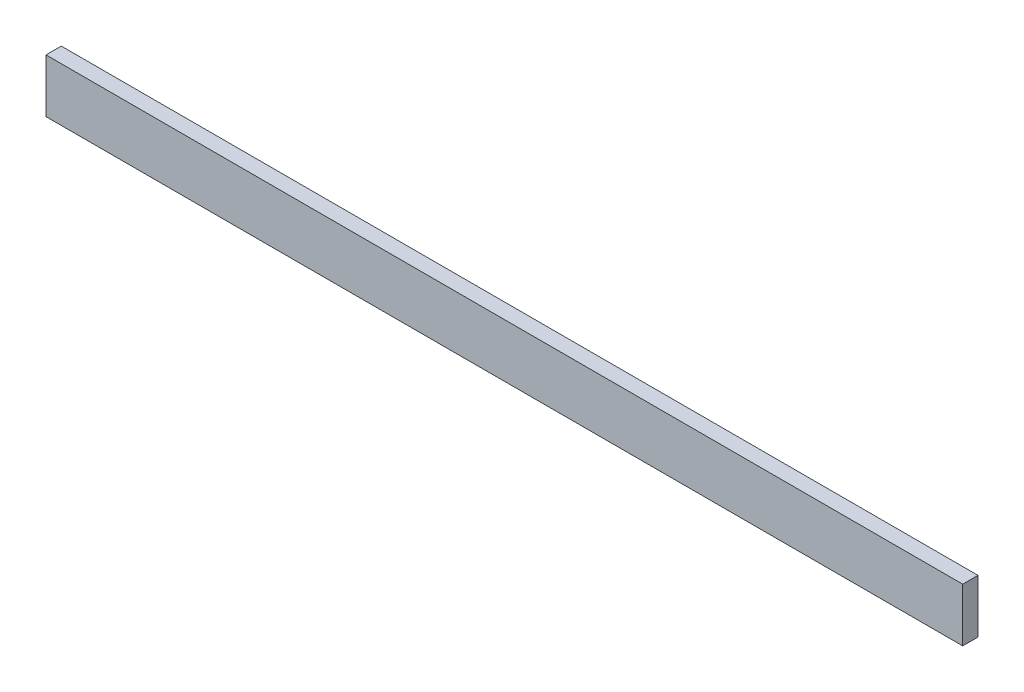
from build123d import *

# Parameters (mm, degrees)
SKETCH_1_W      = 600
SKETCH_1_H      = 35
EXTRUDE_1_DEPTH = 10


with BuildPart() as part:
    # Sketch 1 → Extrude 1 (new body)
    with BuildSketch(Plane.XY):
        Rectangle(SKETCH_1_W, SKETCH_1_H)
    extrude(amount=EXTRUDE_1_DEPTH)


solid = part.part
